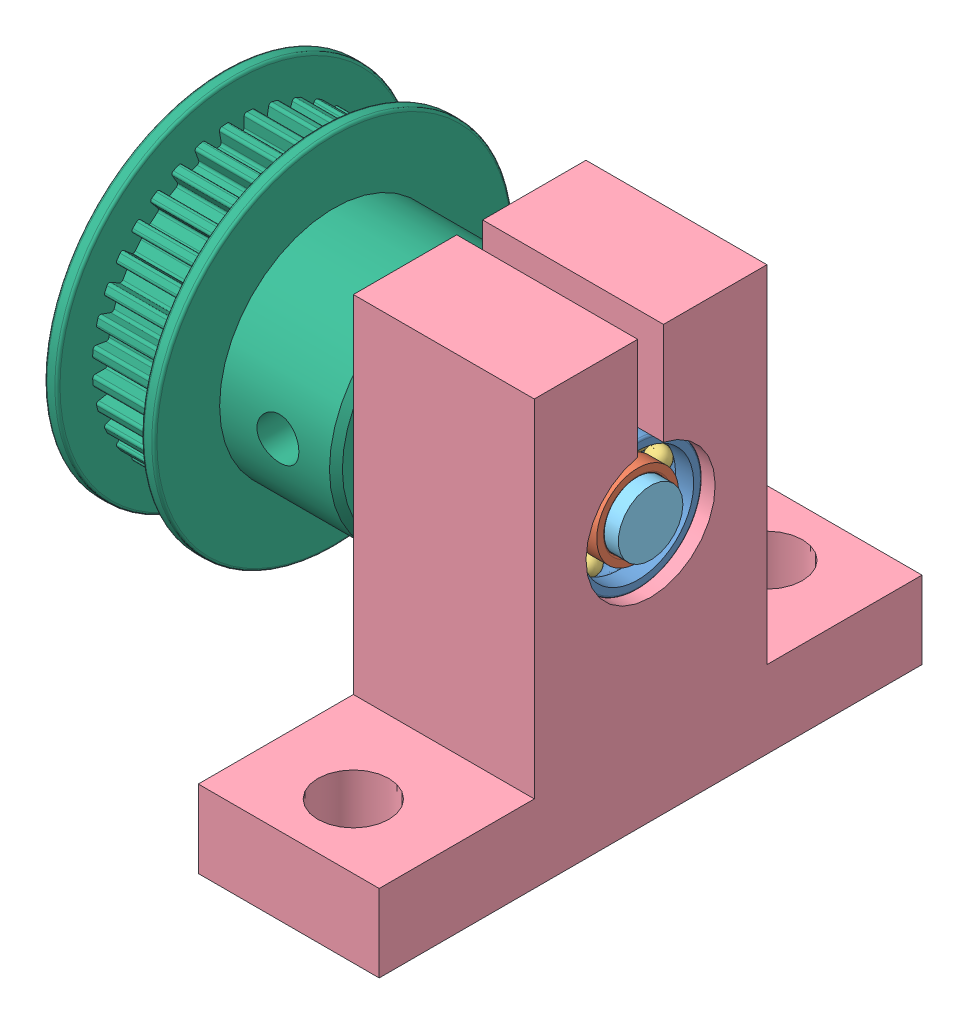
SolidWorks assembly Pulley_with_Bearing.SLDASM, configuration Standard (file format 8000). Lengths in mm.
Overall size (33.2 33.9 42).
18 component instances, 6 part files, 10 mates.
Components (placement in the parent):
- MR105 ZZ-1: MR105 ZZ.SLDASM [Standard] at (-1.2761 0.4213 2.4752) size (4 12.48 12.48)
  - Outer_Bearing-1: Outer_Bearing.SLDPRT [Standard] at (-2.4767 0.2733 10) size (4 10 10)
  - Inner_Bearing-1: Inner_Bearing.SLDPRT [Standard] at (-2.4767 0.2733 10) x (1 0 0) z (0 0.279552 0.960131) size (4 6.33 6.33)
  - bearing_mr105_1_03-1: bearing_mr105_1_03.SLDPRT [Default] at (-2.4767 0.2733 10) x (1 0 0) z (0 -0.287918 0.957655) size (1.67 9.17 9.17)
  - bearing_mr105_1_03-2: bearing_mr105_1_03.SLDPRT [Default] at (-2.4767 0.2733 10) x (1 0 0) z (0 0.488197 0.872733) size (1.67 9.17 9.17)
- SK10-1: SK10.SLDPRT [Standard] at (-6.248 0.6946 12.4752) x (0 0 -1) z (1 0 0) size (42 32.8 14)
- MR105 ZZ-2: MR105 ZZ.SLDASM [Standard] at (-5.2761 0.4213 2.4752) size (4 12.48 12.48)
  - Outer_Bearing-1: Outer_Bearing.SLDPRT [Standard] at (-2.4767 0.2733 10) size (4 10 10)
  - Inner_Bearing-1: Inner_Bearing.SLDPRT [Standard] at (-2.4767 0.2733 10) x (1 0 0) z (0 0.279552 0.960131) size (4 6.33 6.33)
  - bearing_mr105_1_03-1: bearing_mr105_1_03.SLDPRT [Default] at (-2.4767 0.2733 10) x (1 0 0) z (0 -0.287918 0.957655) size (1.67 9.17 9.17)
  - bearing_mr105_1_03-2: bearing_mr105_1_03.SLDPRT [Default] at (-2.4767 0.2733 10) x (1 0 0) z (0 0.488197 0.872733) size (1.67 9.17 9.17)
- MR105 ZZ-3: MR105 ZZ.SLDASM [Standard] at (-9.2761 0.4213 2.4752) size (4 12.48 12.48)
  - Outer_Bearing-1: Outer_Bearing.SLDPRT [Standard] at (-2.4767 0.2733 10) size (4 10 10)
  - Inner_Bearing-1: Inner_Bearing.SLDPRT [Standard] at (-2.4767 0.2733 10) x (1 0 0) z (0 0.279552 0.960131) size (4 6.33 6.33)
  - bearing_mr105_1_03-1: bearing_mr105_1_03.SLDPRT [Default] at (-2.4767 0.2733 10) x (1 0 0) z (0 -0.287918 0.957655) size (1.67 9.17 9.17)
  - bearing_mr105_1_03-2: bearing_mr105_1_03.SLDPRT [Default] at (-2.4767 0.2733 10) x (1 0 0) z (0 0.488197 0.872733) size (1.67 9.17 9.17)
- Teil3-1: Teil3.SLDPRT [Standard] at (0.752 0.6946 12.4752) x (0 1 0) z (0 0 1) size (5 33 5)
- GT2_T36 2-1: GT2_T36 2.SLDPRT [Standard] at (-14.748 0.6946 12.4752) x (0 1 0) z (0 0 1) size (27.8 17.7 27.8)
Mates (geometry in assembly coordinates):
- Konzentrisch1: concentric anti-aligned: cylinder of MR105 ZZ-1/Outer_Bearing-1 through (-0.7529 0.6946 12.4752) axis (-1 0 0) radius 5; cylinder of SK10-1 through (-13.248 0.6946 12.4752) axis (1 0 0) radius 5
- Abstand1: distance = 1 mm aligned: plane of MR105 ZZ-1/Outer_Bearing-1 through (-0.248 5.5446 12.4752) normal (1 0 0); plane of SK10-1 through (0.752 0.6946 12.4752) normal (1 0 0)
- Deckungsgleich2: coincident anti-aligned: plane of MR105 ZZ-1/Outer_Bearing-1 through (-4.248 5.0279 12.4752) normal (-1 0 0); plane of MR105 ZZ-2/Outer_Bearing-1 through (-4.248 5.5446 12.4752) normal (1 0 0)
- Konzentrisch2: concentric anti-aligned: cylinder of SK10-1 through (-13.248 0.6946 12.4752) axis (1 0 0) radius 5; cylinder of MR105 ZZ-2/Outer_Bearing-1 through (-4.7529 0.6946 12.4752) axis (-1 0 0) radius 5
- Deckungsgleich3: coincident anti-aligned: plane of MR105 ZZ-2/Outer_Bearing-1 through (-8.248 5.0279 12.4752) normal (-1 0 0); plane of MR105 ZZ-3/Outer_Bearing-1 through (-8.248 5.5446 12.4752) normal (1 0 0)
- Konzentrisch3: concentric anti-aligned: cylinder of SK10-1 through (-13.248 0.6946 12.4752) axis (1 0 0) radius 5; cylinder of MR105 ZZ-3/Outer_Bearing-1 through (-8.7529 0.6946 12.4752) axis (-1 0 0) radius 5
- Konzentrisch4: concentric anti-aligned: cylinder of MR105 ZZ-1/Inner_Bearing-1 through (-0.7529 0.6946 12.4752) axis (-1 0 0) radius 2.5; cylinder of Teil3-1 through (-32.248 0.6946 12.4752) axis (1 0 0) radius 2.5
- Deckungsgleich4: coincident aligned: plane of SK10-1 through (0.752 0.6946 12.4752) normal (1 0 0); plane of Teil3-1 through (0.752 0.6946 12.4752) normal (1 0 0)
- Konzentrisch5: concentric anti-aligned: cylinder of Teil3-1 through (-32.248 0.6946 12.4752) axis (1 0 0) radius 2.5; cylinder of GT2_T36 2-1 through (-14.748 0.6946 12.4752) axis (-1 0 0) radius 3
- Deckungsgleich5: coincident aligned: plane of Teil3-1 through (-32.248 0.6946 12.4752) normal (-1 0 0); plane of GT2_T36 2-1 through (-32.248 0.6946 12.4752) normal (-1 0 0)
